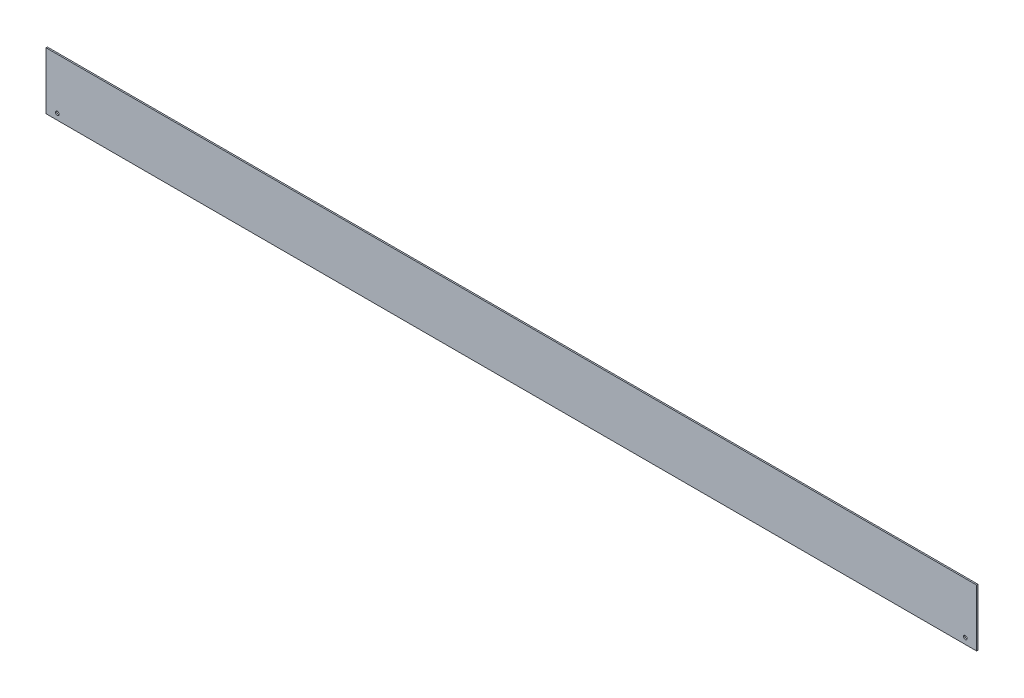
from build123d import *

# Parameters (mm, degrees)
SKETCH1_W          = 261.93776326
SKETCH1_H          = 16.089
EXTRUDE1_DEPTH     = 0.381
SKETCH2_R          = 0.508
CUT_EXTRUDE1_DEPTH = 132.216260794


with BuildPart() as part:
    # Sketch1 → Extrude1 (new body)
    with BuildSketch(Plane.XY):
        Rectangle(SKETCH1_W, SKETCH1_H)
    extrude(amount=EXTRUDE1_DEPTH)

    # Sketch2 → Cut-Extrude1 (cut, through all)
    with BuildSketch(Plane.XY.offset(0.381)):
        with Locations((-127.79388163, -6.3445)):
            Circle(SKETCH2_R)
        with Locations(Location((127.79388163, -6.3445, 0), (0, 0, 180))):
            Circle(SKETCH2_R)
    extrude(amount=-CUT_EXTRUDE1_DEPTH, mode=Mode.SUBTRACT)


solid = part.part
